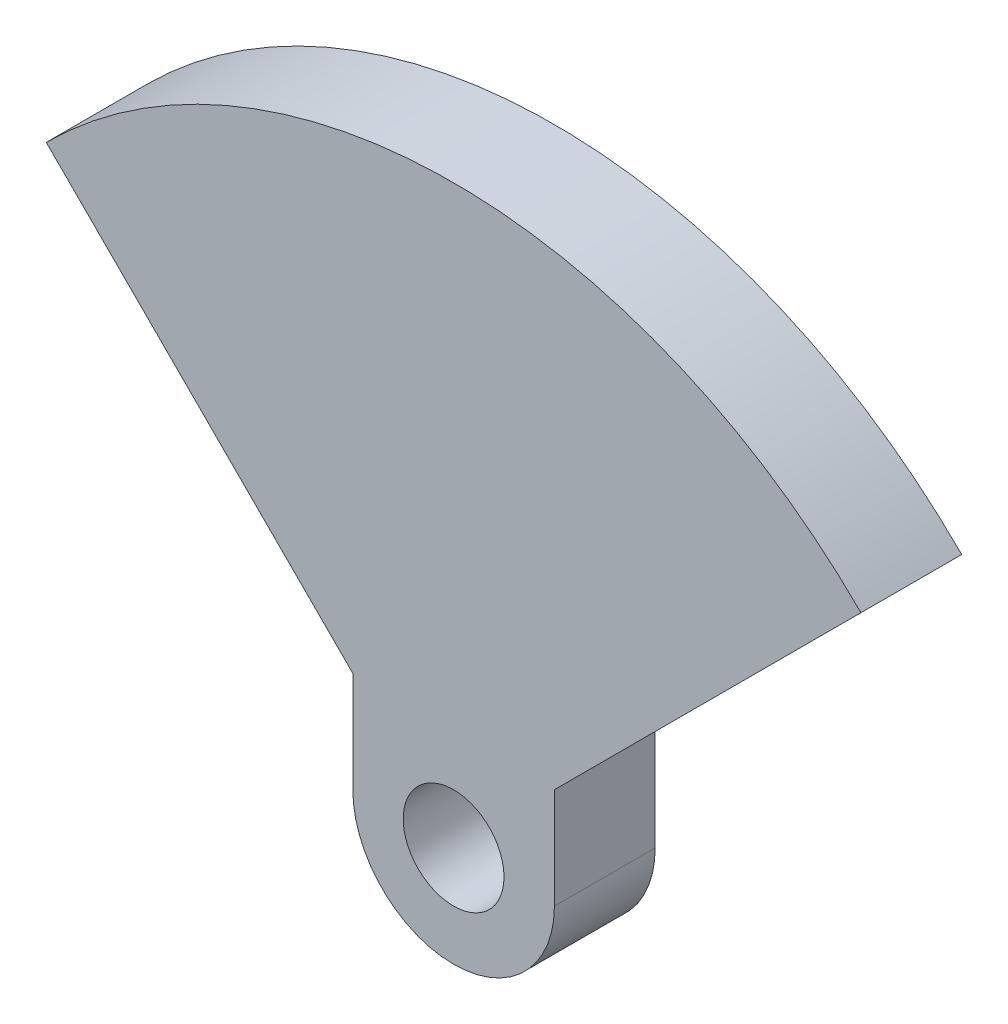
from build123d import *

# Parameters (mm, degrees)
SKETCH1_R           = 2.999999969
BOSS_EXTRUDE1_DEPTH = 5.999999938


with BuildPart() as part:
    # Sketch1 → Boss-Extrude1 (new body)
    with BuildSketch(Plane.XY):
        with BuildLine():
            Line((-5.999999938, 0), (-5.999999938, 5.999999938))
            Line((-5.999999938, 5.999999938), (-24.246691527, 24.246691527))
            ThreePointArc((-24.246691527, 24.246691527), (0, 34.29), (24.246691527, 24.246691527))
            Line((24.246691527, 24.246691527), (5.999999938, 5.999999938))
            Line((5.999999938, 5.999999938), (5.999999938, 0))
            ThreePointArc((5.999999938, 0), (0, -5.999999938), (-5.999999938, 0))
        make_face()
        Circle(SKETCH1_R, mode=Mode.SUBTRACT)
    extrude(amount=BOSS_EXTRUDE1_DEPTH)


solid = part.part
